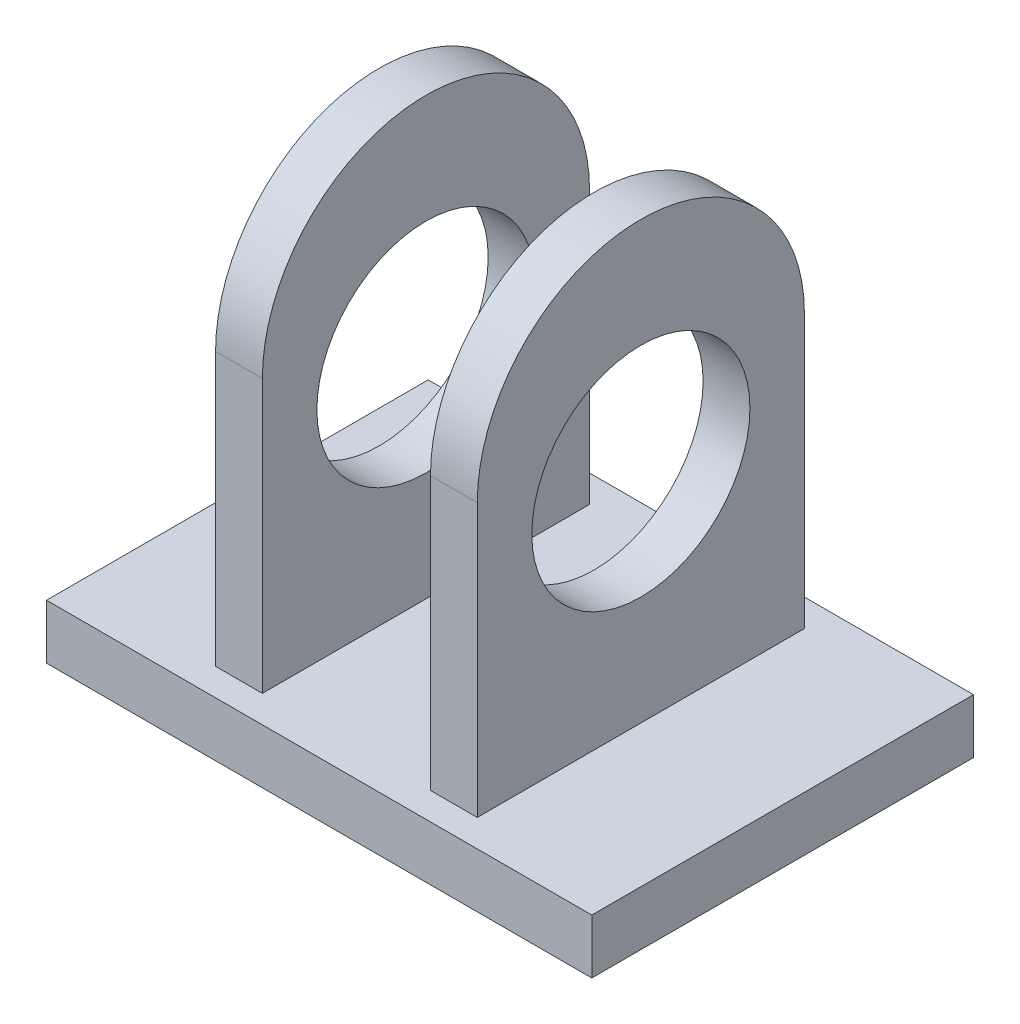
ISO-10303-21;
HEADER;
FILE_DESCRIPTION(('STEP AP214'),'2;1');
FILE_NAME('part.step','',(''),(''),'','','');
FILE_SCHEMA(('AUTOMOTIVE_DESIGN { 1 0 10303 214 1 1 1 1 }'));
ENDSEC;
DATA;
#1=APPLICATION_CONTEXT('core data for automotive mechanical design processes');
#2=APPLICATION_PROTOCOL_DEFINITION('international standard','automotive_design',2000,#1);
#3=PRODUCT_CONTEXT('',#1,'mechanical');
#4=PRODUCT('Part','Part','',(#3));
#5=PRODUCT_RELATED_PRODUCT_CATEGORY('part','',(#4));
#6=PRODUCT_DEFINITION_FORMATION('','',#4);
#7=PRODUCT_DEFINITION_CONTEXT('part definition',#1,'design');
#8=PRODUCT_DEFINITION('design','',#6,#7);
#9=PRODUCT_DEFINITION_SHAPE('','',#8);
#10=(LENGTH_UNIT() NAMED_UNIT(*) SI_UNIT(.MILLI.,.METRE.));
#11=(NAMED_UNIT(*) PLANE_ANGLE_UNIT() SI_UNIT($,.RADIAN.));
#12=(NAMED_UNIT(*) SI_UNIT($,.STERADIAN.) SOLID_ANGLE_UNIT());
#13=UNCERTAINTY_MEASURE_WITH_UNIT(LENGTH_MEASURE(1.E-05),#10,'distance_accuracy_value','');
#14=(GEOMETRIC_REPRESENTATION_CONTEXT(3) GLOBAL_UNCERTAINTY_ASSIGNED_CONTEXT((#13)) GLOBAL_UNIT_ASSIGNED_CONTEXT((#10,
#11,#12)) REPRESENTATION_CONTEXT('',''));
#15=CARTESIAN_POINT('',(0.,0.,0.));
#16=DIRECTION('',(0.,0.,1.));
#17=DIRECTION('',(1.,0.,0.));
#18=AXIS2_PLACEMENT_3D('',#15,#16,#17);
#19=CARTESIAN_POINT('',(-12.,35.,0.));
#20=DIRECTION('',(-1.,0.,0.));
#21=DIRECTION('',(0.,0.,1.));
#22=AXIS2_PLACEMENT_3D('',#19,#20,#21);
#23=CYLINDRICAL_SURFACE('',#22,15.);
#24=CARTESIAN_POINT('',(7.70823837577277,35.,0.));
#25=DIRECTION('',(1.,0.,0.));
#26=DIRECTION('',(0.,0.,-1.));
#27=AXIS2_PLACEMENT_3D('',#24,#25,#26);
#28=CIRCLE('',#27,15.);
#29=CARTESIAN_POINT('',(7.70823837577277,35.,15.));
#30=VERTEX_POINT('',#29);
#31=CARTESIAN_POINT('',(7.70823837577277,35.,-15.));
#32=VERTEX_POINT('',#31);
#33=EDGE_CURVE('E283',#30,#32,#28,.F.);
#34=ORIENTED_EDGE('',*,*,#33,.F.);
#35=DIRECTION('',(-1.,0.,0.));
#36=VECTOR('',#35,1.);
#37=CARTESIAN_POINT('',(-12.,35.,15.));
#38=LINE('',#37,#36);
#39=CARTESIAN_POINT('',(12.,35.,15.));
#40=VERTEX_POINT('',#39);
#41=EDGE_CURVE('E253',#40,#30,#38,.T.);
#42=ORIENTED_EDGE('',*,*,#41,.F.);
#43=CARTESIAN_POINT('',(12.,35.,0.));
#44=DIRECTION('',(-1.,0.,0.));
#45=DIRECTION('',(0.,0.,1.));
#46=AXIS2_PLACEMENT_3D('',#43,#44,#45);
#47=CIRCLE('',#46,15.);
#48=CARTESIAN_POINT('',(12.,35.,-15.));
#49=VERTEX_POINT('',#48);
#50=EDGE_CURVE('E11',#49,#40,#47,.F.);
#51=ORIENTED_EDGE('',*,*,#50,.F.);
#52=DIRECTION('',(-1.,0.,0.));
#53=VECTOR('',#52,1.);
#54=CARTESIAN_POINT('',(-12.,35.,-15.));
#55=LINE('',#54,#53);
#56=EDGE_CURVE('E247',#32,#49,#55,.F.);
#57=ORIENTED_EDGE('',*,*,#56,.F.);
#58=EDGE_LOOP('',(#34,#42,#51,#57));
#59=FACE_BOUND('',#58,.T.);
#60=ADVANCED_FACE('F43',(#59),#23,.T.);
#61=CARTESIAN_POINT('',(-12.,50.,-15.));
#62=DIRECTION('',(0.,0.,1.));
#63=DIRECTION('',(1.,0.,0.));
#64=AXIS2_PLACEMENT_3D('',#61,#62,#63);
#65=PLANE('',#64);
#66=DIRECTION('',(-1.,0.,0.));
#67=VECTOR('',#66,1.);
#68=CARTESIAN_POINT('',(-12.,10.,-15.));
#69=LINE('',#68,#67);
#70=CARTESIAN_POINT('',(12.,10.,-15.));
#71=VERTEX_POINT('',#70);
#72=CARTESIAN_POINT('',(7.70823837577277,10.,-15.));
#73=VERTEX_POINT('',#72);
#74=EDGE_CURVE('E161',#71,#73,#69,.T.);
#75=ORIENTED_EDGE('',*,*,#74,.T.);
#76=DIRECTION('',(0.,1.,0.));
#77=VECTOR('',#76,1.);
#78=CARTESIAN_POINT('',(7.70823837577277,50.,-15.));
#79=LINE('',#78,#77);
#80=EDGE_CURVE('E262',#73,#32,#79,.T.);
#81=ORIENTED_EDGE('',*,*,#80,.T.);
#82=ORIENTED_EDGE('',*,*,#56,.T.);
#83=DIRECTION('',(0.,-1.,0.));
#84=VECTOR('',#83,1.);
#85=CARTESIAN_POINT('',(12.,50.,-15.));
#86=LINE('',#85,#84);
#87=EDGE_CURVE('E189',#49,#71,#86,.T.);
#88=ORIENTED_EDGE('',*,*,#87,.T.);
#89=EDGE_LOOP('',(#75,#81,#82,#88));
#90=FACE_BOUND('',#89,.T.);
#91=ADVANCED_FACE('F308',(#90),#65,.F.);
#92=CARTESIAN_POINT('',(-12.,50.,15.));
#93=DIRECTION('',(0.,0.,-1.));
#94=DIRECTION('',(-1.,0.,0.));
#95=AXIS2_PLACEMENT_3D('',#92,#93,#94);
#96=PLANE('',#95);
#97=ORIENTED_EDGE('',*,*,#41,.T.);
#98=DIRECTION('',(0.,-1.,0.));
#99=VECTOR('',#98,1.);
#100=CARTESIAN_POINT('',(7.70823837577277,50.,15.));
#101=LINE('',#100,#99);
#102=CARTESIAN_POINT('',(7.70823837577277,10.,15.));
#103=VERTEX_POINT('',#102);
#104=EDGE_CURVE('E280',#30,#103,#101,.T.);
#105=ORIENTED_EDGE('',*,*,#104,.T.);
#106=DIRECTION('',(1.,0.,0.));
#107=VECTOR('',#106,1.);
#108=CARTESIAN_POINT('',(-12.,10.,15.));
#109=LINE('',#108,#107);
#110=CARTESIAN_POINT('',(12.,10.,15.));
#111=VERTEX_POINT('',#110);
#112=EDGE_CURVE('E175',#103,#111,#109,.T.);
#113=ORIENTED_EDGE('',*,*,#112,.T.);
#114=DIRECTION('',(0.,-1.,0.));
#115=VECTOR('',#114,1.);
#116=CARTESIAN_POINT('',(12.,50.,15.));
#117=LINE('',#116,#115);
#118=EDGE_CURVE('E179',#40,#111,#117,.T.);
#119=ORIENTED_EDGE('',*,*,#118,.F.);
#120=EDGE_LOOP('',(#97,#105,#113,#119));
#121=FACE_BOUND('',#120,.T.);
#122=ADVANCED_FACE('F298',(#121),#96,.F.);
#123=CARTESIAN_POINT('',(23.5,30.,0.));
#124=DIRECTION('',(-1.,0.,0.));
#125=DIRECTION('',(0.,0.,1.));
#126=AXIS2_PLACEMENT_3D('',#123,#124,#125);
#127=CYLINDRICAL_SURFACE('',#126,10.);
#128=CARTESIAN_POINT('',(7.70823837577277,30.,0.));
#129=DIRECTION('',(1.,0.,0.));
#130=DIRECTION('',(0.,0.,-1.));
#131=AXIS2_PLACEMENT_3D('',#128,#129,#130);
#132=CIRCLE('',#131,10.);
#133=CARTESIAN_POINT('',(7.70823837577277,30.,-10.));
#134=VERTEX_POINT('',#133);
#135=EDGE_CURVE('E48',#134,#134,#132,.F.);
#136=ORIENTED_EDGE('',*,*,#135,.T.);
#137=EDGE_LOOP('',(#136));
#138=FACE_BOUND('',#137,.T.);
#139=CARTESIAN_POINT('',(12.,30.,0.));
#140=DIRECTION('',(-1.,0.,0.));
#141=DIRECTION('',(0.,0.,1.));
#142=AXIS2_PLACEMENT_3D('',#139,#140,#141);
#143=CIRCLE('',#142,10.);
#144=CARTESIAN_POINT('',(12.,30.,10.));
#145=VERTEX_POINT('',#144);
#146=EDGE_CURVE('E169',#145,#145,#143,.T.);
#147=ORIENTED_EDGE('',*,*,#146,.F.);
#148=EDGE_LOOP('',(#147));
#149=FACE_BOUND('',#148,.T.);
#150=ADVANCED_FACE('F296',(#138,#149),#127,.F.);
#151=CARTESIAN_POINT('',(-7.70823837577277,35.,0.));
#152=DIRECTION('',(-1.,0.,0.));
#153=DIRECTION('',(0.,0.,1.));
#154=AXIS2_PLACEMENT_3D('',#151,#152,#153);
#155=CIRCLE('',#154,15.);
#156=CARTESIAN_POINT('',(-7.70823837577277,35.,-15.));
#157=VERTEX_POINT('',#156);
#158=CARTESIAN_POINT('',(-7.70823837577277,35.,15.));
#159=VERTEX_POINT('',#158);
#160=EDGE_CURVE('E62',#157,#159,#155,.F.);
#161=ORIENTED_EDGE('',*,*,#160,.F.);
#162=CARTESIAN_POINT('',(-12.,35.,-15.));
#163=VERTEX_POINT('',#162);
#164=EDGE_CURVE('E152',#163,#157,#55,.F.);
#165=ORIENTED_EDGE('',*,*,#164,.F.);
#166=CARTESIAN_POINT('',(-12.,35.,0.));
#167=DIRECTION('',(1.,0.,0.));
#168=DIRECTION('',(0.,0.,-1.));
#169=AXIS2_PLACEMENT_3D('',#166,#167,#168);
#170=CIRCLE('',#169,15.);
#171=CARTESIAN_POINT('',(-12.,35.,15.));
#172=VERTEX_POINT('',#171);
#173=EDGE_CURVE('E54',#172,#163,#170,.F.);
#174=ORIENTED_EDGE('',*,*,#173,.F.);
#175=EDGE_CURVE('E69',#159,#172,#38,.T.);
#176=ORIENTED_EDGE('',*,*,#175,.F.);
#177=EDGE_LOOP('',(#161,#165,#174,#176));
#178=FACE_BOUND('',#177,.T.);
#179=ADVANCED_FACE('F46',(#178),#23,.T.);
#180=CARTESIAN_POINT('',(0.,10.,0.));
#181=DIRECTION('',(0.,-1.,0.));
#182=DIRECTION('',(0.,0.,-1.));
#183=AXIS2_PLACEMENT_3D('',#180,#181,#182);
#184=PLANE('',#183);
#185=DIRECTION('',(0.,0.,1.));
#186=VECTOR('',#185,1.);
#187=CARTESIAN_POINT('',(7.70823837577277,10.,-20.5));
#188=LINE('',#187,#186);
#189=EDGE_CURVE('E143',#73,#103,#188,.T.);
#190=ORIENTED_EDGE('',*,*,#189,.F.);
#191=ORIENTED_EDGE('',*,*,#74,.F.);
#192=DIRECTION('',(0.,0.,-1.));
#193=VECTOR('',#192,1.);
#194=CARTESIAN_POINT('',(12.,10.,15.));
#195=LINE('',#194,#193);
#196=EDGE_CURVE('E162',#111,#71,#195,.T.);
#197=ORIENTED_EDGE('',*,*,#196,.F.);
#198=ORIENTED_EDGE('',*,*,#112,.F.);
#199=EDGE_LOOP('',(#190,#191,#197,#198));
#200=FACE_BOUND('',#199,.T.);
#201=DIRECTION('',(0.,0.,1.));
#202=VECTOR('',#201,1.);
#203=CARTESIAN_POINT('',(-7.70823837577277,10.,-20.5));
#204=LINE('',#203,#202);
#205=CARTESIAN_POINT('',(-7.70823837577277,10.,-15.));
#206=VERTEX_POINT('',#205);
#207=CARTESIAN_POINT('',(-7.70823837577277,10.,15.));
#208=VERTEX_POINT('',#207);
#209=EDGE_CURVE('E133',#206,#208,#204,.T.);
#210=ORIENTED_EDGE('',*,*,#209,.T.);
#211=CARTESIAN_POINT('',(-12.,10.,15.));
#212=VERTEX_POINT('',#211);
#213=EDGE_CURVE('E176',#212,#208,#109,.T.);
#214=ORIENTED_EDGE('',*,*,#213,.F.);
#215=DIRECTION('',(0.,0.,1.));
#216=VECTOR('',#215,1.);
#217=CARTESIAN_POINT('',(-12.,10.,15.));
#218=LINE('',#217,#216);
#219=CARTESIAN_POINT('',(-12.,10.,-15.));
#220=VERTEX_POINT('',#219);
#221=EDGE_CURVE('E159',#220,#212,#218,.T.);
#222=ORIENTED_EDGE('',*,*,#221,.F.);
#223=EDGE_CURVE('E149',#206,#220,#69,.T.);
#224=ORIENTED_EDGE('',*,*,#223,.F.);
#225=EDGE_LOOP('',(#210,#214,#222,#224));
#226=FACE_BOUND('',#225,.T.);
#227=DIRECTION('',(1.,0.,0.));
#228=VECTOR('',#227,1.);
#229=CARTESIAN_POINT('',(-25.,10.,17.5));
#230=LINE('',#229,#228);
#231=CARTESIAN_POINT('',(-25.,10.,17.5));
#232=VERTEX_POINT('',#231);
#233=CARTESIAN_POINT('',(25.,10.,17.5));
#234=VERTEX_POINT('',#233);
#235=EDGE_CURVE('E204',#232,#234,#230,.T.);
#236=ORIENTED_EDGE('',*,*,#235,.T.);
#237=DIRECTION('',(0.,0.,-1.));
#238=VECTOR('',#237,1.);
#239=CARTESIAN_POINT('',(25.,10.,17.5));
#240=LINE('',#239,#238);
#241=CARTESIAN_POINT('',(25.,10.,-17.5));
#242=VERTEX_POINT('',#241);
#243=EDGE_CURVE('E193',#234,#242,#240,.T.);
#244=ORIENTED_EDGE('',*,*,#243,.T.);
#245=DIRECTION('',(-1.,0.,0.));
#246=VECTOR('',#245,1.);
#247=CARTESIAN_POINT('',(-25.,10.,-17.5));
#248=LINE('',#247,#246);
#249=CARTESIAN_POINT('',(-25.,10.,-17.5));
#250=VERTEX_POINT('',#249);
#251=EDGE_CURVE('E197',#242,#250,#248,.T.);
#252=ORIENTED_EDGE('',*,*,#251,.T.);
#253=DIRECTION('',(0.,0.,1.));
#254=VECTOR('',#253,1.);
#255=CARTESIAN_POINT('',(-25.,10.,17.5));
#256=LINE('',#255,#254);
#257=EDGE_CURVE('E201',#250,#232,#256,.T.);
#258=ORIENTED_EDGE('',*,*,#257,.T.);
#259=EDGE_LOOP('',(#236,#244,#252,#258));
#260=FACE_BOUND('',#259,.T.);
#261=ADVANCED_FACE('F156',(#200,#226,#260),#184,.F.);
#262=CARTESIAN_POINT('',(0.,5.,0.));
#263=DIRECTION('',(0.,-1.,0.));
#264=DIRECTION('',(0.,0.,-1.));
#265=AXIS2_PLACEMENT_3D('',#262,#263,#264);
#266=CYLINDRICAL_SURFACE('',#265,11.5);
#267=CARTESIAN_POINT('',(0.,5.,0.));
#268=DIRECTION('',(0.,1.,0.));
#269=DIRECTION('',(0.,0.,1.));
#270=AXIS2_PLACEMENT_3D('',#267,#268,#269);
#271=CIRCLE('',#270,11.5);
#272=CARTESIAN_POINT('',(0.,5.,11.5));
#273=VERTEX_POINT('',#272);
#274=EDGE_CURVE('E243',#273,#273,#271,.T.);
#275=ORIENTED_EDGE('',*,*,#274,.F.);
#276=EDGE_LOOP('',(#275));
#277=FACE_BOUND('',#276,.T.);
#278=CARTESIAN_POINT('',(0.,0.,0.));
#279=DIRECTION('',(0.,1.,0.));
#280=DIRECTION('',(0.,0.,1.));
#281=AXIS2_PLACEMENT_3D('',#278,#279,#280);
#282=CIRCLE('',#281,11.5);
#283=CARTESIAN_POINT('',(0.,0.,11.5));
#284=VERTEX_POINT('',#283);
#285=EDGE_CURVE('E239',#284,#284,#282,.T.);
#286=ORIENTED_EDGE('',*,*,#285,.T.);
#287=EDGE_LOOP('',(#286));
#288=FACE_BOUND('',#287,.T.);
#289=ADVANCED_FACE('F400',(#277,#288),#266,.T.);
#290=CARTESIAN_POINT('',(0.,0.,0.));
#291=DIRECTION('',(0.,1.,0.));
#292=DIRECTION('',(0.,0.,1.));
#293=AXIS2_PLACEMENT_3D('',#290,#291,#292);
#294=PLANE('',#293);
#295=CARTESIAN_POINT('',(0.,0.,0.));
#296=DIRECTION('',(0.,-1.,0.));
#297=DIRECTION('',(0.,0.,-1.));
#298=AXIS2_PLACEMENT_3D('',#295,#296,#297);
#299=CIRCLE('',#298,10.5);
#300=CARTESIAN_POINT('',(0.,0.,-10.5));
#301=VERTEX_POINT('',#300);
#302=EDGE_CURVE('E235',#301,#301,#299,.T.);
#303=ORIENTED_EDGE('',*,*,#302,.F.);
#304=EDGE_LOOP('',(#303));
#305=FACE_BOUND('',#304,.T.);
#306=ORIENTED_EDGE('',*,*,#285,.F.);
#307=EDGE_LOOP('',(#306));
#308=FACE_BOUND('',#307,.T.);
#309=ADVANCED_FACE('F531',(#305,#308),#294,.F.);
#310=CARTESIAN_POINT('',(0.,9.,0.));
#311=DIRECTION('',(0.,-1.,0.));
#312=DIRECTION('',(0.,0.,-1.));
#313=AXIS2_PLACEMENT_3D('',#310,#311,#312);
#314=CYLINDRICAL_SURFACE('',#313,10.5);
#315=CARTESIAN_POINT('',(0.,5.,0.));
#316=DIRECTION('',(0.,1.,0.));
#317=DIRECTION('',(0.,0.,1.));
#318=AXIS2_PLACEMENT_3D('',#315,#316,#317);
#319=CIRCLE('',#318,10.5);
#320=CARTESIAN_POINT('',(0.,5.,10.5));
#321=VERTEX_POINT('',#320);
#322=EDGE_CURVE('E234',#321,#321,#319,.T.);
#323=ORIENTED_EDGE('',*,*,#322,.T.);
#324=EDGE_LOOP('',(#323));
#325=FACE_BOUND('',#324,.T.);
#326=ORIENTED_EDGE('',*,*,#302,.T.);
#327=EDGE_LOOP('',(#326));
#328=FACE_BOUND('',#327,.T.);
#329=ADVANCED_FACE('F522',(#325,#328),#314,.F.);
#330=CARTESIAN_POINT('',(0.,5.,0.));
#331=DIRECTION('',(0.,-1.,0.));
#332=DIRECTION('',(0.,0.,-1.));
#333=AXIS2_PLACEMENT_3D('',#330,#331,#332);
#334=PLANE('',#333);
#335=ORIENTED_EDGE('',*,*,#274,.T.);
#336=EDGE_LOOP('',(#335));
#337=FACE_BOUND('',#336,.T.);
#338=DIRECTION('',(0.,0.,-1.));
#339=VECTOR('',#338,1.);
#340=CARTESIAN_POINT('',(25.,5.,17.5));
#341=LINE('',#340,#339);
#342=CARTESIAN_POINT('',(25.,5.,17.5));
#343=VERTEX_POINT('',#342);
#344=CARTESIAN_POINT('',(25.,5.,-17.5));
#345=VERTEX_POINT('',#344);
#346=EDGE_CURVE('E192',#343,#345,#341,.T.);
#347=ORIENTED_EDGE('',*,*,#346,.F.);
#348=DIRECTION('',(1.,0.,0.));
#349=VECTOR('',#348,1.);
#350=CARTESIAN_POINT('',(-25.,5.,17.5));
#351=LINE('',#350,#349);
#352=CARTESIAN_POINT('',(-25.,5.,17.5));
#353=VERTEX_POINT('',#352);
#354=EDGE_CURVE('E198',#353,#343,#351,.T.);
#355=ORIENTED_EDGE('',*,*,#354,.F.);
#356=DIRECTION('',(0.,0.,1.));
#357=VECTOR('',#356,1.);
#358=CARTESIAN_POINT('',(-25.,5.,17.5));
#359=LINE('',#358,#357);
#360=CARTESIAN_POINT('',(-25.,5.,-17.5));
#361=VERTEX_POINT('',#360);
#362=EDGE_CURVE('E214',#361,#353,#359,.T.);
#363=ORIENTED_EDGE('',*,*,#362,.F.);
#364=DIRECTION('',(-1.,0.,0.));
#365=VECTOR('',#364,1.);
#366=CARTESIAN_POINT('',(-25.,5.,-17.5));
#367=LINE('',#366,#365);
#368=EDGE_CURVE('E211',#345,#361,#367,.T.);
#369=ORIENTED_EDGE('',*,*,#368,.F.);
#370=EDGE_LOOP('',(#347,#355,#363,#369));
#371=FACE_BOUND('',#370,.T.);
#372=ADVANCED_FACE('F477',(#337,#371),#334,.T.);
#373=CARTESIAN_POINT('',(-25.,10.,17.5));
#374=DIRECTION('',(0.,0.,-1.));
#375=DIRECTION('',(-1.,0.,0.));
#376=AXIS2_PLACEMENT_3D('',#373,#374,#375);
#377=PLANE('',#376);
#378=ORIENTED_EDGE('',*,*,#354,.T.);
#379=DIRECTION('',(0.,-1.,0.));
#380=VECTOR('',#379,1.);
#381=CARTESIAN_POINT('',(25.,10.,17.5));
#382=LINE('',#381,#380);
#383=EDGE_CURVE('E207',#234,#343,#382,.T.);
#384=ORIENTED_EDGE('',*,*,#383,.F.);
#385=ORIENTED_EDGE('',*,*,#235,.F.);
#386=DIRECTION('',(0.,-1.,0.));
#387=VECTOR('',#386,1.);
#388=CARTESIAN_POINT('',(-25.,10.,17.5));
#389=LINE('',#388,#387);
#390=EDGE_CURVE('E222',#232,#353,#389,.T.);
#391=ORIENTED_EDGE('',*,*,#390,.T.);
#392=EDGE_LOOP('',(#378,#384,#385,#391));
#393=FACE_BOUND('',#392,.T.);
#394=ADVANCED_FACE('F504',(#393),#377,.F.);
#395=CARTESIAN_POINT('',(-25.,10.,17.5));
#396=DIRECTION('',(1.,0.,0.));
#397=DIRECTION('',(0.,0.,-1.));
#398=AXIS2_PLACEMENT_3D('',#395,#396,#397);
#399=PLANE('',#398);
#400=ORIENTED_EDGE('',*,*,#362,.T.);
#401=ORIENTED_EDGE('',*,*,#390,.F.);
#402=ORIENTED_EDGE('',*,*,#257,.F.);
#403=DIRECTION('',(0.,-1.,0.));
#404=VECTOR('',#403,1.);
#405=CARTESIAN_POINT('',(-25.,10.,-17.5));
#406=LINE('',#405,#404);
#407=EDGE_CURVE('E226',#250,#361,#406,.T.);
#408=ORIENTED_EDGE('',*,*,#407,.T.);
#409=EDGE_LOOP('',(#400,#401,#402,#408));
#410=FACE_BOUND('',#409,.T.);
#411=ADVANCED_FACE('F495',(#410),#399,.F.);
#412=CARTESIAN_POINT('',(-25.,10.,-17.5));
#413=DIRECTION('',(0.,0.,1.));
#414=DIRECTION('',(1.,0.,0.));
#415=AXIS2_PLACEMENT_3D('',#412,#413,#414);
#416=PLANE('',#415);
#417=ORIENTED_EDGE('',*,*,#368,.T.);
#418=ORIENTED_EDGE('',*,*,#407,.F.);
#419=ORIENTED_EDGE('',*,*,#251,.F.);
#420=DIRECTION('',(0.,-1.,0.));
#421=VECTOR('',#420,1.);
#422=CARTESIAN_POINT('',(25.,10.,-17.5));
#423=LINE('',#422,#421);
#424=EDGE_CURVE('E230',#242,#345,#423,.T.);
#425=ORIENTED_EDGE('',*,*,#424,.T.);
#426=EDGE_LOOP('',(#417,#418,#419,#425));
#427=FACE_BOUND('',#426,.T.);
#428=ADVANCED_FACE('F485',(#427),#416,.F.);
#429=CARTESIAN_POINT('',(25.,10.,17.5));
#430=DIRECTION('',(-1.,0.,0.));
#431=DIRECTION('',(0.,0.,1.));
#432=AXIS2_PLACEMENT_3D('',#429,#430,#431);
#433=PLANE('',#432);
#434=ORIENTED_EDGE('',*,*,#346,.T.);
#435=ORIENTED_EDGE('',*,*,#424,.F.);
#436=ORIENTED_EDGE('',*,*,#243,.F.);
#437=ORIENTED_EDGE('',*,*,#383,.T.);
#438=EDGE_LOOP('',(#434,#435,#436,#437));
#439=FACE_BOUND('',#438,.T.);
#440=ADVANCED_FACE('F474',(#439),#433,.F.);
#441=ORIENTED_EDGE('',*,*,#322,.F.);
#442=EDGE_LOOP('',(#441));
#443=FACE_BOUND('',#442,.T.);
#444=ADVANCED_FACE('F463',(#443),#334,.T.);
#445=CARTESIAN_POINT('',(12.,50.,15.));
#446=DIRECTION('',(-1.,0.,0.));
#447=DIRECTION('',(0.,0.,1.));
#448=AXIS2_PLACEMENT_3D('',#445,#446,#447);
#449=PLANE('',#448);
#450=ORIENTED_EDGE('',*,*,#146,.T.);
#451=EDGE_LOOP('',(#450));
#452=FACE_BOUND('',#451,.T.);
#453=ORIENTED_EDGE('',*,*,#87,.F.);
#454=ORIENTED_EDGE('',*,*,#50,.T.);
#455=ORIENTED_EDGE('',*,*,#118,.T.);
#456=ORIENTED_EDGE('',*,*,#196,.T.);
#457=EDGE_LOOP('',(#453,#454,#455,#456));
#458=FACE_BOUND('',#457,.T.);
#459=ADVANCED_FACE('F293',(#452,#458),#449,.F.);
#460=ORIENTED_EDGE('',*,*,#164,.T.);
#461=DIRECTION('',(0.,-1.,0.));
#462=VECTOR('',#461,1.);
#463=CARTESIAN_POINT('',(-7.70823837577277,50.,-15.));
#464=LINE('',#463,#462);
#465=EDGE_CURVE('E136',#157,#206,#464,.T.);
#466=ORIENTED_EDGE('',*,*,#465,.T.);
#467=ORIENTED_EDGE('',*,*,#223,.T.);
#468=DIRECTION('',(0.,-1.,0.));
#469=VECTOR('',#468,1.);
#470=CARTESIAN_POINT('',(-12.,50.,-15.));
#471=LINE('',#470,#469);
#472=EDGE_CURVE('E186',#163,#220,#471,.T.);
#473=ORIENTED_EDGE('',*,*,#472,.F.);
#474=EDGE_LOOP('',(#460,#466,#467,#473));
#475=FACE_BOUND('',#474,.T.);
#476=ADVANCED_FACE('F147',(#475),#65,.F.);
#477=CARTESIAN_POINT('',(-12.,50.,15.));
#478=DIRECTION('',(1.,0.,0.));
#479=DIRECTION('',(0.,0.,-1.));
#480=AXIS2_PLACEMENT_3D('',#477,#478,#479);
#481=PLANE('',#480);
#482=CARTESIAN_POINT('',(-12.,30.,0.));
#483=DIRECTION('',(1.,0.,0.));
#484=DIRECTION('',(0.,0.,-1.));
#485=AXIS2_PLACEMENT_3D('',#482,#483,#484);
#486=CIRCLE('',#485,10.);
#487=CARTESIAN_POINT('',(-12.,30.,-10.));
#488=VERTEX_POINT('',#487);
#489=EDGE_CURVE('E259',#488,#488,#486,.T.);
#490=ORIENTED_EDGE('',*,*,#489,.T.);
#491=EDGE_LOOP('',(#490));
#492=FACE_BOUND('',#491,.T.);
#493=DIRECTION('',(0.,-1.,0.));
#494=VECTOR('',#493,1.);
#495=CARTESIAN_POINT('',(-12.,50.,15.));
#496=LINE('',#495,#494);
#497=EDGE_CURVE('E183',#172,#212,#496,.T.);
#498=ORIENTED_EDGE('',*,*,#497,.F.);
#499=ORIENTED_EDGE('',*,*,#173,.T.);
#500=ORIENTED_EDGE('',*,*,#472,.T.);
#501=ORIENTED_EDGE('',*,*,#221,.T.);
#502=EDGE_LOOP('',(#498,#499,#500,#501));
#503=FACE_BOUND('',#502,.T.);
#504=ADVANCED_FACE('F441',(#492,#503),#481,.F.);
#505=ORIENTED_EDGE('',*,*,#213,.T.);
#506=DIRECTION('',(0.,1.,0.));
#507=VECTOR('',#506,1.);
#508=CARTESIAN_POINT('',(-7.70823837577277,50.,15.));
#509=LINE('',#508,#507);
#510=EDGE_CURVE('E137',#208,#159,#509,.T.);
#511=ORIENTED_EDGE('',*,*,#510,.T.);
#512=ORIENTED_EDGE('',*,*,#175,.T.);
#513=ORIENTED_EDGE('',*,*,#497,.T.);
#514=EDGE_LOOP('',(#505,#511,#512,#513));
#515=FACE_BOUND('',#514,.T.);
#516=ADVANCED_FACE('F311',(#515),#96,.F.);
#517=CARTESIAN_POINT('',(-7.70823837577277,30.,0.));
#518=DIRECTION('',(-1.,0.,0.));
#519=DIRECTION('',(0.,0.,1.));
#520=AXIS2_PLACEMENT_3D('',#517,#518,#519);
#521=CIRCLE('',#520,10.);
#522=CARTESIAN_POINT('',(-7.70823837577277,30.,10.));
#523=VERTEX_POINT('',#522);
#524=EDGE_CURVE('E263',#523,#523,#521,.F.);
#525=ORIENTED_EDGE('',*,*,#524,.T.);
#526=EDGE_LOOP('',(#525));
#527=FACE_BOUND('',#526,.T.);
#528=ORIENTED_EDGE('',*,*,#489,.F.);
#529=EDGE_LOOP('',(#528));
#530=FACE_BOUND('',#529,.T.);
#531=ADVANCED_FACE('F301',(#527,#530),#127,.F.);
#532=CARTESIAN_POINT('',(7.70823837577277,10.,-20.5));
#533=DIRECTION('',(1.,0.,0.));
#534=DIRECTION('',(0.,0.,-1.));
#535=AXIS2_PLACEMENT_3D('',#532,#533,#534);
#536=PLANE('',#535);
#537=ORIENTED_EDGE('',*,*,#135,.F.);
#538=EDGE_LOOP('',(#537));
#539=FACE_BOUND('',#538,.T.);
#540=ORIENTED_EDGE('',*,*,#189,.T.);
#541=ORIENTED_EDGE('',*,*,#104,.F.);
#542=ORIENTED_EDGE('',*,*,#33,.T.);
#543=ORIENTED_EDGE('',*,*,#80,.F.);
#544=EDGE_LOOP('',(#540,#541,#542,#543));
#545=FACE_BOUND('',#544,.T.);
#546=ADVANCED_FACE('F315',(#539,#545),#536,.F.);
#547=CARTESIAN_POINT('',(-7.70823837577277,10.,-20.5));
#548=DIRECTION('',(-1.,0.,0.));
#549=DIRECTION('',(0.,0.,1.));
#550=AXIS2_PLACEMENT_3D('',#547,#548,#549);
#551=PLANE('',#550);
#552=ORIENTED_EDGE('',*,*,#524,.F.);
#553=EDGE_LOOP('',(#552));
#554=FACE_BOUND('',#553,.T.);
#555=ORIENTED_EDGE('',*,*,#160,.T.);
#556=ORIENTED_EDGE('',*,*,#510,.F.);
#557=ORIENTED_EDGE('',*,*,#209,.F.);
#558=ORIENTED_EDGE('',*,*,#465,.F.);
#559=EDGE_LOOP('',(#555,#556,#557,#558));
#560=FACE_BOUND('',#559,.T.);
#561=ADVANCED_FACE('F135',(#554,#560),#551,.F.);
#562=CLOSED_SHELL('',(#60,#91,#122,#150,#179,#261,#289,#309,#329,#372,#394,#411,#428,#440,#444,
#459,#476,#504,#516,#531,#546,#561));
#563=MANIFOLD_SOLID_BREP('B2',#562);
#564=ADVANCED_BREP_SHAPE_REPRESENTATION('',(#18,#563),#14);
#565=SHAPE_DEFINITION_REPRESENTATION(#9,#564);
ENDSEC;
END-ISO-10303-21;
